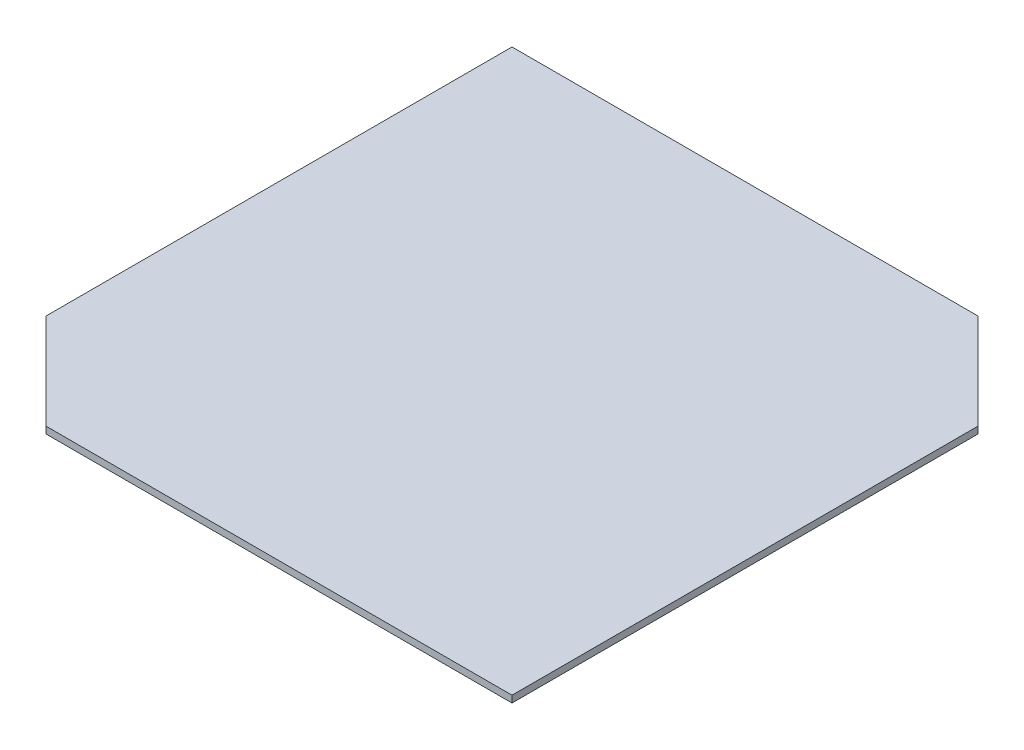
from build123d import *

# Parameters (mm, degrees)
SKETCH1_W      = 412
SKETCH1_H      = 412
EXTRUDE1_DEPTH = 5
CHAMFER1_SIZE  = 70


with BuildPart() as part:
    # Sketch1 → Extrude1 (new body)
    with BuildSketch(Plane(origin=(0, 0, 0), x_dir=(1, 0, 0), z_dir=(0, 1, 0))):
        Rectangle(SKETCH1_W, SKETCH1_H)
    extrude(amount=EXTRUDE1_DEPTH)

    # Chamfer1
    chamfer1_edges = [part.edges().sort_by_distance(p)[0] for p in [
        (206, 2.5, -206),
        (-206, 2.5, 206),
    ]]
    chamfer(chamfer1_edges, length=CHAMFER1_SIZE)


solid = part.part
